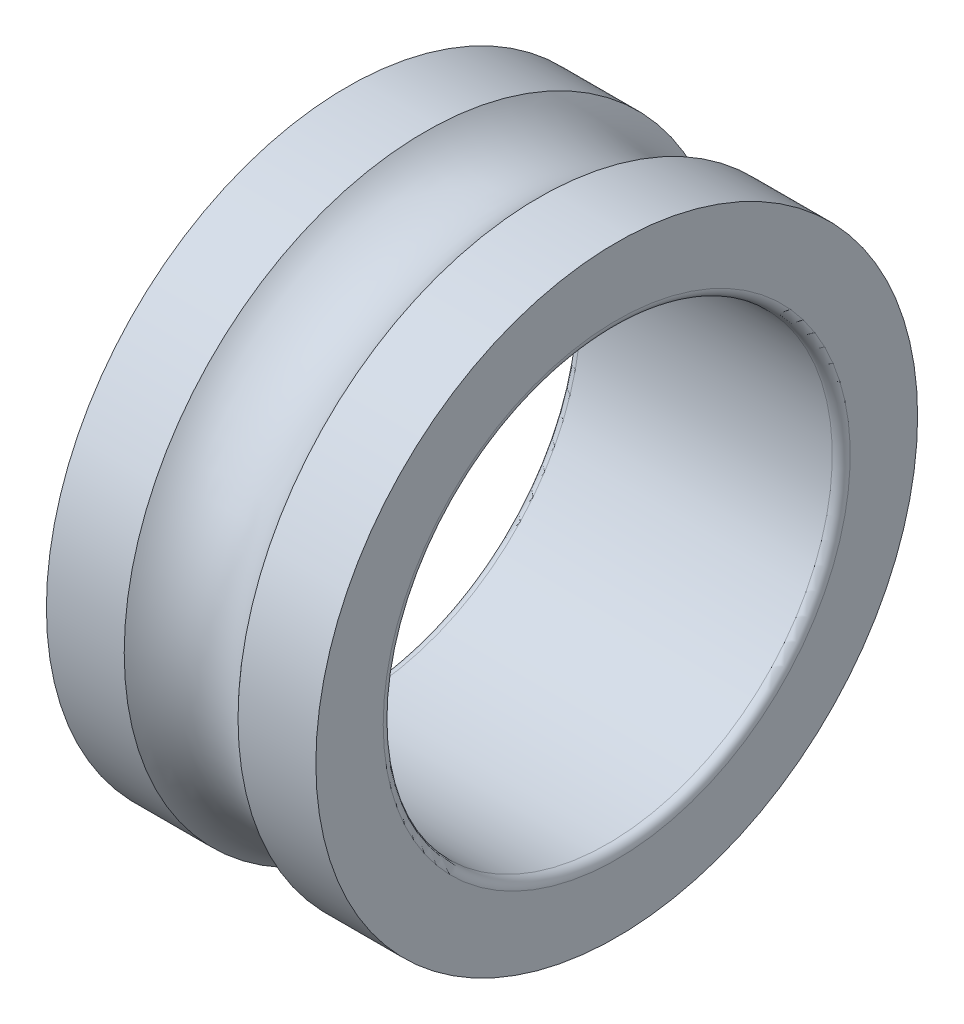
from build123d import *


with BuildPart() as part:
    # Esquisse1 → Base-R_volution (revolve)
    with BuildSketch(Plane(origin=(0, 0, 0), x_dir=(1, 0, 0), z_dir=(0, 1, 0)), mode=Mode.PRIVATE) as base_r_volution_sk:
        with BuildLine():
            Line((0, 10.05), (0, 7.8))
            ThreePointArc((0, 7.8), (0.087867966, 7.587867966), (0.3, 7.5))
            Line((0.3, 7.5), (8.7, 7.5))
            ThreePointArc((8.7, 7.5), (8.912132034, 7.587867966), (9, 7.8))
            Line((9, 7.8), (9, 10.05))
            Line((9, 10.05), (6.400657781, 10.05))
            ThreePointArc((6.400657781, 10.05), (4.5, 9.2), (2.599342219, 10.05))
            Line((2.599342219, 10.05), (0, 10.05))
        make_face()
    revolve(base_r_volution_sk.sketch.rotate(Axis((0, 0, 0), (1, 0, 0)), 180), axis=Axis((0, 0, 0), (1, 0, 0)))


solid = part.part
